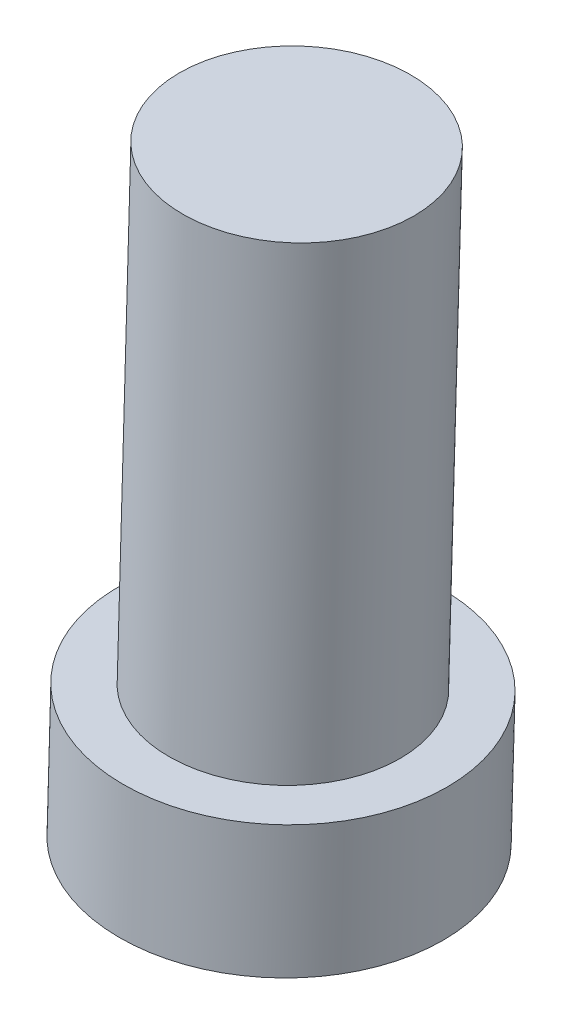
from build123d import *


with BuildPart() as part:
    # Esquisse1 → R_volution1 (revolve)
    with BuildSketch(Plane.XY.offset(-216.567475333)):
        Polygon((-182.617937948, 44.424645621), (-192.613797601, 44.71237777), (-194.113827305, -7.398887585), (-180.11962379, -7.801712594), (-179.789374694, 3.671192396), (-183.787718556, 3.786285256), align=None)
    revolve(axis=Axis((-192.603180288, 45.081224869, -216.567475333), (-0.028773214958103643, -0.9995859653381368, 0)))


solid = part.part
